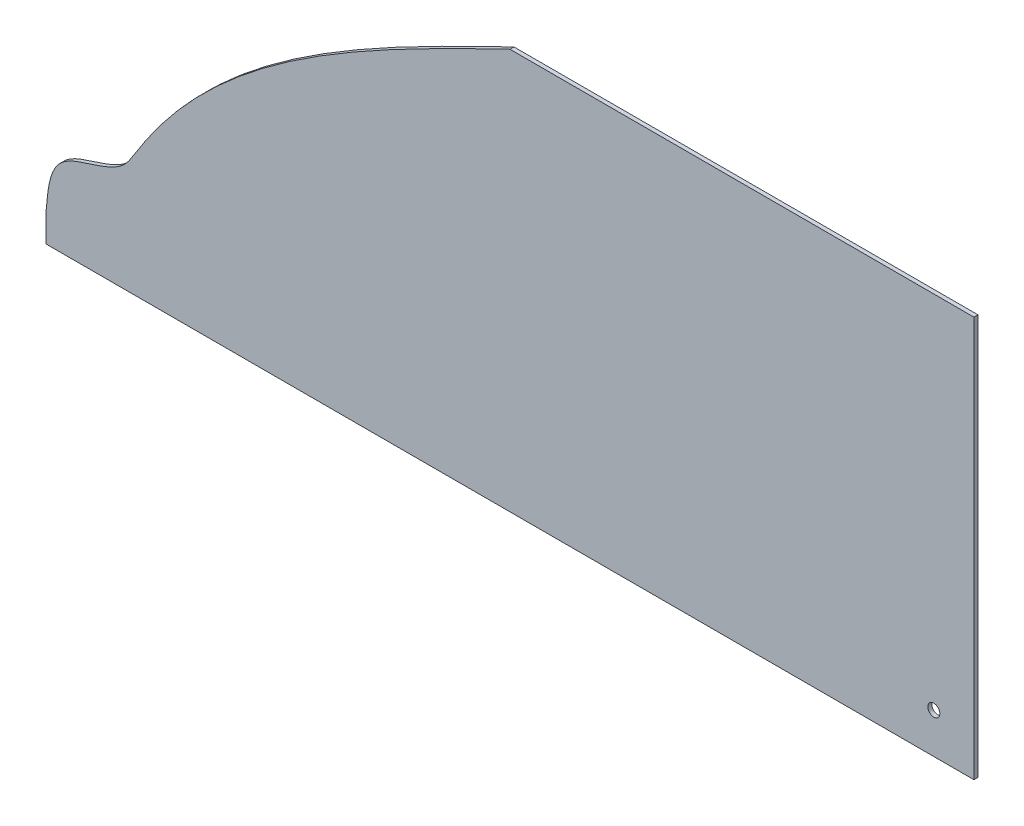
from build123d import *

# Parameters (mm, degrees)
SKETCH1_W               = 230.980836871
SKETCH1_H               = 99.719955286
SKETCH1_R               = 1.5
EXTRUDE1_DEPTH          = 1
CUT_EXTRUDE1_DEPTH      = 252.589380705
CUT_EXTRUDE1_DEPTH_BACK = 252.589380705


with BuildPart() as part:
    # Sketch1 → Extrude1 (new body)
    with BuildSketch(Plane.XY):
        with Locations((115.490418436, 49.859977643)):
            Rectangle(SKETCH1_W, SKETCH1_H)
        with Locations((220.980836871, 10)):
            Circle(SKETCH1_R, mode=Mode.SUBTRACT)
    extrude(amount=EXTRUDE1_DEPTH)

    # Sketch2 → Cut-Extrude1 (cut, two sides: drawn at the far end of the back side and taken through both)
    with BuildSketch(Plane.XY.offset(1).offset(-CUT_EXTRUDE1_DEPTH_BACK)):
        with BuildLine():
            Line((0, 99.719955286), (0, 6.928499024))
            add(Edge.make_bspline(
                [(0, 6.928499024), (0.395379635, 11.62181818), (1.343240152, 22.873313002), (17.574504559, 22.720124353), (41.38633815, 63.726903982), (79.331111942, 82.157038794), (115.490418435, 99.719955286)],
                knots=[0, 0, 0, 0, 0.083095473, 0.199208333, 0.236889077, 1, 1, 1, 1], degree=3))
            Line((115.490418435, 99.719955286), (0, 99.719955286))
        make_face()
    extrude(amount=CUT_EXTRUDE1_DEPTH + CUT_EXTRUDE1_DEPTH_BACK, mode=Mode.SUBTRACT)


solid = part.part
